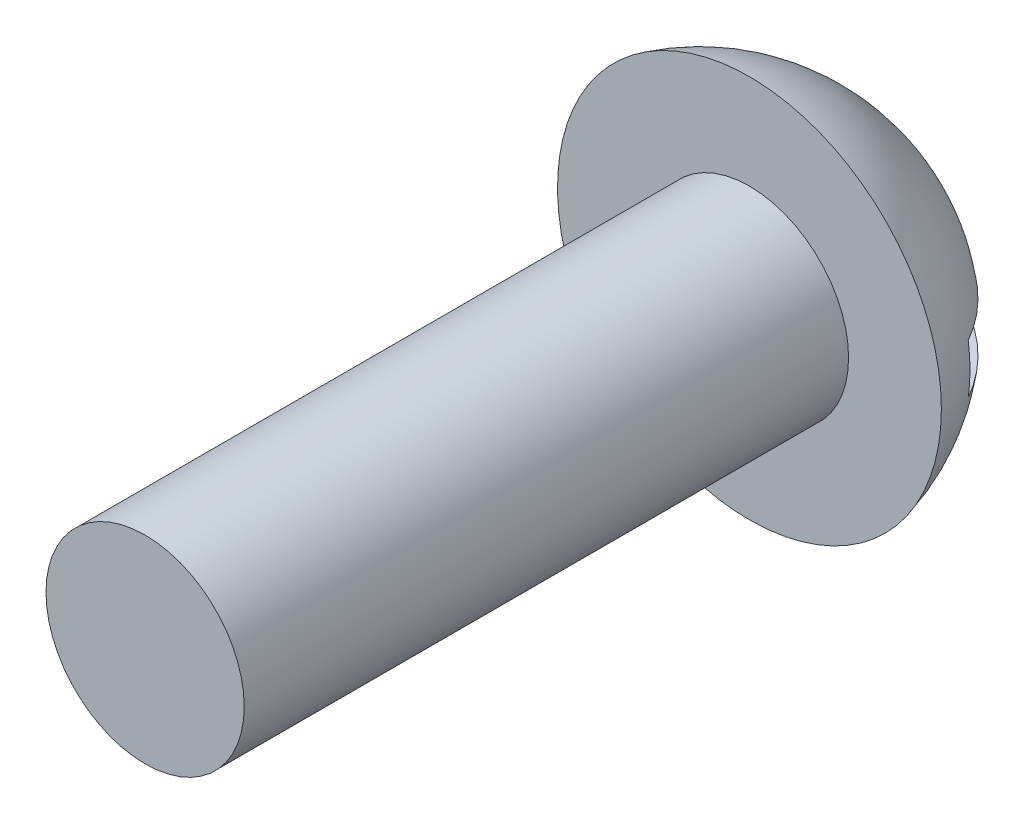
ISO-10303-21;
HEADER;
FILE_DESCRIPTION(('STEP AP214'),'2;1');
FILE_NAME('part.step','',(''),(''),'','','');
FILE_SCHEMA(('AUTOMOTIVE_DESIGN { 1 0 10303 214 1 1 1 1 }'));
ENDSEC;
DATA;
#1=APPLICATION_CONTEXT('core data for automotive mechanical design processes');
#2=APPLICATION_PROTOCOL_DEFINITION('international standard','automotive_design',2000,#1);
#3=PRODUCT_CONTEXT('',#1,'mechanical');
#4=PRODUCT('Part','Part','',(#3));
#5=PRODUCT_RELATED_PRODUCT_CATEGORY('part','',(#4));
#6=PRODUCT_DEFINITION_FORMATION('','',#4);
#7=PRODUCT_DEFINITION_CONTEXT('part definition',#1,'design');
#8=PRODUCT_DEFINITION('design','',#6,#7);
#9=PRODUCT_DEFINITION_SHAPE('','',#8);
#10=(LENGTH_UNIT() NAMED_UNIT(*) SI_UNIT(.MILLI.,.METRE.));
#11=(NAMED_UNIT(*) PLANE_ANGLE_UNIT() SI_UNIT($,.RADIAN.));
#12=(NAMED_UNIT(*) SI_UNIT($,.STERADIAN.) SOLID_ANGLE_UNIT());
#13=UNCERTAINTY_MEASURE_WITH_UNIT(LENGTH_MEASURE(1.E-05),#10,'distance_accuracy_value','');
#14=(GEOMETRIC_REPRESENTATION_CONTEXT(3) GLOBAL_UNCERTAINTY_ASSIGNED_CONTEXT((#13)) GLOBAL_UNIT_ASSIGNED_CONTEXT((#10,
#11,#12)) REPRESENTATION_CONTEXT('',''));
#15=CARTESIAN_POINT('',(0.,0.,0.));
#16=DIRECTION('',(0.,0.,1.));
#17=DIRECTION('',(1.,0.,0.));
#18=AXIS2_PLACEMENT_3D('',#15,#16,#17);
#19=CARTESIAN_POINT('',(0.,15.282157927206,23.9014));
#20=DIRECTION('',(0.,0.,1.));
#21=DIRECTION('',(0.,1.,0.));
#22=AXIS2_PLACEMENT_3D('',#19,#20,#21);
#23=SPHERICAL_SURFACE('',#22,4.1656);
#24=CARTESIAN_POINT('',(0.,15.282157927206,22.86));
#25=DIRECTION('',(0.,0.,1.));
#26=DIRECTION('',(1.,0.,0.));
#27=AXIS2_PLACEMENT_3D('',#24,#25,#26);
#28=CIRCLE('',#27,4.0333248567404);
#29=CARTESIAN_POINT('',(4.0333248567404,15.282157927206,22.86));
#30=VERTEX_POINT('',#29);
#31=EDGE_CURVE('E70',#30,#30,#28,.T.);
#32=ORIENTED_EDGE('',*,*,#31,.F.);
#33=EDGE_LOOP('',(#32));
#34=FACE_BOUND('',#33,.T.);
#35=CARTESIAN_POINT('',(0.,15.282157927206,21.851271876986));
#36=DIRECTION('',(0.,0.,-1.));
#37=DIRECTION('',(-1.,0.,0.));
#38=AXIS2_PLACEMENT_3D('',#35,#36,#37);
#39=CIRCLE('',#38,3.62618229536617);
#40=CARTESIAN_POINT('',(3.58860272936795,15.802857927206,21.851271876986));
#41=VERTEX_POINT('',#40);
#42=CARTESIAN_POINT('',(3.58860272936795,14.761457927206,21.851271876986));
#43=VERTEX_POINT('',#42);
#44=EDGE_CURVE('E63',#41,#43,#39,.T.);
#45=ORIENTED_EDGE('',*,*,#44,.F.);
#46=CARTESIAN_POINT('',(0.,15.802857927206,23.9014));
#47=DIRECTION('',(0.,1.,0.));
#48=DIRECTION('',(0.,0.,1.));
#49=AXIS2_PLACEMENT_3D('',#46,#47,#48);
#50=CIRCLE('',#49,4.132928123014);
#51=CARTESIAN_POINT('',(-3.58860272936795,15.802857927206,21.851271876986));
#52=VERTEX_POINT('',#51);
#53=EDGE_CURVE('E76',#41,#52,#50,.T.);
#54=ORIENTED_EDGE('',*,*,#53,.T.);
#55=CARTESIAN_POINT('',(0.,15.282157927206,21.851271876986));
#56=DIRECTION('',(0.,0.,1.));
#57=DIRECTION('',(1.,0.,0.));
#58=AXIS2_PLACEMENT_3D('',#55,#56,#57);
#59=CIRCLE('',#58,3.62618229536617);
#60=CARTESIAN_POINT('',(-3.58860272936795,14.761457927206,21.851271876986));
#61=VERTEX_POINT('',#60);
#62=EDGE_CURVE('E38',#52,#61,#59,.T.);
#63=ORIENTED_EDGE('',*,*,#62,.T.);
#64=CARTESIAN_POINT('',(0.,14.761457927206,23.9014));
#65=DIRECTION('',(0.,-1.,0.));
#66=DIRECTION('',(0.,0.,-1.));
#67=AXIS2_PLACEMENT_3D('',#64,#65,#66);
#68=CIRCLE('',#67,4.132928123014);
#69=EDGE_CURVE('E11',#61,#43,#68,.T.);
#70=ORIENTED_EDGE('',*,*,#69,.T.);
#71=EDGE_LOOP('',(#45,#54,#63,#70));
#72=FACE_BOUND('',#71,.T.);
#73=ADVANCED_FACE('F30',(#34,#72),#23,.T.);
#74=CARTESIAN_POINT('',(0.,19.3154827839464,22.86));
#75=DIRECTION('',(0.,0.,-1.));
#76=DIRECTION('',(-1.,0.,0.));
#77=AXIS2_PLACEMENT_3D('',#74,#75,#76);
#78=PLANE('',#77);
#79=ORIENTED_EDGE('',*,*,#31,.T.);
#80=EDGE_LOOP('',(#79));
#81=FACE_BOUND('',#80,.T.);
#82=CARTESIAN_POINT('',(0.,15.24,22.86));
#83=DIRECTION('',(0.,0.,-1.));
#84=DIRECTION('',(-1.,0.,0.));
#85=AXIS2_PLACEMENT_3D('',#82,#83,#84);
#86=CIRCLE('',#85,2.0828);
#87=CARTESIAN_POINT('',(-2.0828,15.24,22.86));
#88=VERTEX_POINT('',#87);
#89=EDGE_CURVE('E73',#88,#88,#86,.F.);
#90=ORIENTED_EDGE('',*,*,#89,.F.);
#91=EDGE_LOOP('',(#90));
#92=FACE_BOUND('',#91,.T.);
#93=ADVANCED_FACE('F32',(#81,#92),#78,.F.);
#94=CARTESIAN_POINT('',(0.,15.24,35.56));
#95=DIRECTION('',(0.,0.,-1.));
#96=DIRECTION('',(-1.,0.,0.));
#97=AXIS2_PLACEMENT_3D('',#94,#95,#96);
#98=CYLINDRICAL_SURFACE('',#97,2.0828);
#99=CARTESIAN_POINT('',(0.,15.24,35.56));
#100=DIRECTION('',(0.,0.,1.));
#101=DIRECTION('',(1.,0.,0.));
#102=AXIS2_PLACEMENT_3D('',#99,#100,#101);
#103=CIRCLE('',#102,2.0828);
#104=CARTESIAN_POINT('',(2.0828,15.24,35.56));
#105=VERTEX_POINT('',#104);
#106=EDGE_CURVE('E57',#105,#105,#103,.T.);
#107=ORIENTED_EDGE('',*,*,#106,.F.);
#108=EDGE_LOOP('',(#107));
#109=FACE_BOUND('',#108,.T.);
#110=ORIENTED_EDGE('',*,*,#89,.T.);
#111=EDGE_LOOP('',(#110));
#112=FACE_BOUND('',#111,.T.);
#113=ADVANCED_FACE('F91',(#109,#112),#98,.T.);
#114=CARTESIAN_POINT('',(0.,15.24,35.56));
#115=DIRECTION('',(0.,0.,1.));
#116=DIRECTION('',(1.,0.,0.));
#117=AXIS2_PLACEMENT_3D('',#114,#115,#116);
#118=PLANE('',#117);
#119=ORIENTED_EDGE('',*,*,#106,.T.);
#120=EDGE_LOOP('',(#119));
#121=FACE_BOUND('',#120,.T.);
#122=ADVANCED_FACE('F96',(#121),#118,.T.);
#123=CARTESIAN_POINT('',(-4.0333248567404,14.761457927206,21.851271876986));
#124=DIRECTION('',(0.,-1.,0.));
#125=DIRECTION('',(0.,0.,-1.));
#126=AXIS2_PLACEMENT_3D('',#123,#124,#125);
#127=PLANE('',#126);
#128=DIRECTION('',(1.,0.,0.));
#129=VECTOR('',#128,1.);
#130=CARTESIAN_POINT('',(-4.0333248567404,14.761457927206,21.851271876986));
#131=LINE('',#130,#129);
#132=EDGE_CURVE('E54',#61,#43,#131,.T.);
#133=ORIENTED_EDGE('',*,*,#132,.T.);
#134=ORIENTED_EDGE('',*,*,#69,.F.);
#135=EDGE_LOOP('',(#133,#134));
#136=FACE_BOUND('',#135,.T.);
#137=ADVANCED_FACE('F55',(#136),#127,.F.);
#138=CARTESIAN_POINT('',(-4.0333248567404,15.802857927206,21.851271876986));
#139=DIRECTION('',(0.,0.,1.));
#140=DIRECTION('',(1.,0.,0.));
#141=AXIS2_PLACEMENT_3D('',#138,#139,#140);
#142=PLANE('',#141);
#143=DIRECTION('',(1.,0.,0.));
#144=VECTOR('',#143,1.);
#145=CARTESIAN_POINT('',(-4.0333248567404,15.802857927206,21.851271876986));
#146=LINE('',#145,#144);
#147=EDGE_CURVE('E58',#52,#41,#146,.T.);
#148=ORIENTED_EDGE('',*,*,#147,.T.);
#149=ORIENTED_EDGE('',*,*,#44,.T.);
#150=ORIENTED_EDGE('',*,*,#132,.F.);
#151=ORIENTED_EDGE('',*,*,#62,.F.);
#152=EDGE_LOOP('',(#148,#149,#150,#151));
#153=FACE_BOUND('',#152,.T.);
#154=ADVANCED_FACE('F64',(#153),#142,.F.);
#155=CARTESIAN_POINT('',(-4.0333248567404,15.802857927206,21.851271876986));
#156=DIRECTION('',(0.,1.,0.));
#157=DIRECTION('',(0.,0.,1.));
#158=AXIS2_PLACEMENT_3D('',#155,#156,#157);
#159=PLANE('',#158);
#160=ORIENTED_EDGE('',*,*,#53,.F.);
#161=ORIENTED_EDGE('',*,*,#147,.F.);
#162=EDGE_LOOP('',(#160,#161));
#163=FACE_BOUND('',#162,.T.);
#164=ADVANCED_FACE('F78',(#163),#159,.F.);
#165=CLOSED_SHELL('',(#73,#93,#113,#122,#137,#154,#164));
#166=MANIFOLD_SOLID_BREP('B2',#165);
#167=ADVANCED_BREP_SHAPE_REPRESENTATION('',(#18,#166),#14);
#168=SHAPE_DEFINITION_REPRESENTATION(#9,#167);
ENDSEC;
END-ISO-10303-21;
